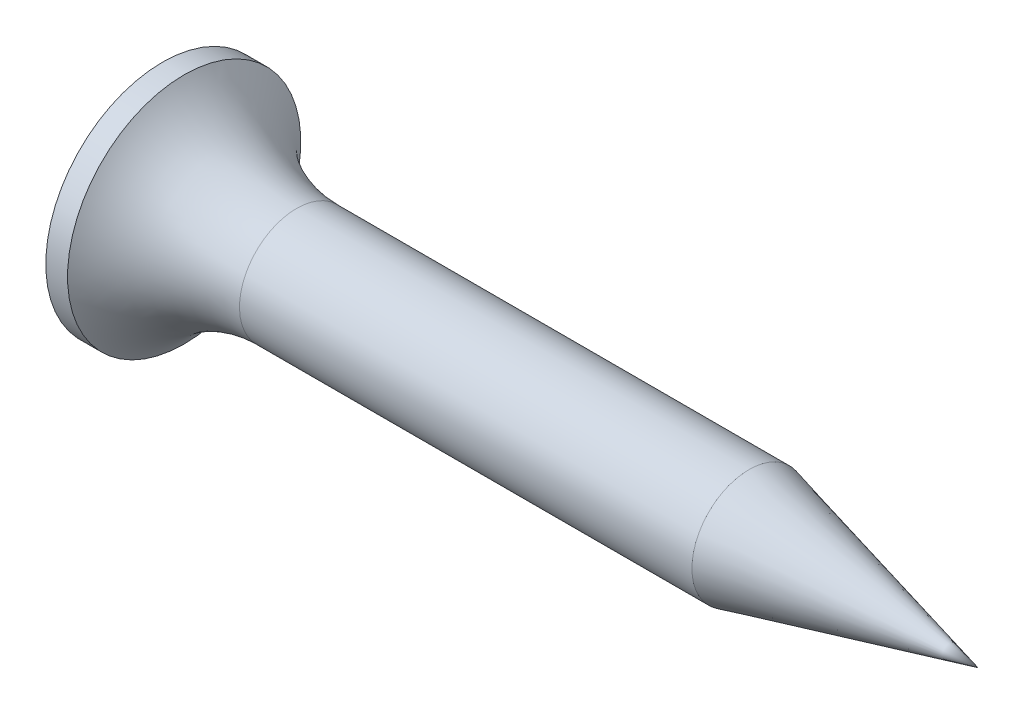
ISO-10303-21;
HEADER;
FILE_DESCRIPTION(('STEP AP214'),'2;1');
FILE_NAME('part.step','',(''),(''),'','','');
FILE_SCHEMA(('AUTOMOTIVE_DESIGN { 1 0 10303 214 1 1 1 1 }'));
ENDSEC;
DATA;
#1=APPLICATION_CONTEXT('core data for automotive mechanical design processes');
#2=APPLICATION_PROTOCOL_DEFINITION('international standard','automotive_design',2000,#1);
#3=PRODUCT_CONTEXT('',#1,'mechanical');
#4=PRODUCT('Part','Part','',(#3));
#5=PRODUCT_RELATED_PRODUCT_CATEGORY('part','',(#4));
#6=PRODUCT_DEFINITION_FORMATION('','',#4);
#7=PRODUCT_DEFINITION_CONTEXT('part definition',#1,'design');
#8=PRODUCT_DEFINITION('design','',#6,#7);
#9=PRODUCT_DEFINITION_SHAPE('','',#8);
#10=(LENGTH_UNIT() NAMED_UNIT(*) SI_UNIT(.MILLI.,.METRE.));
#11=(NAMED_UNIT(*) PLANE_ANGLE_UNIT() SI_UNIT($,.RADIAN.));
#12=(NAMED_UNIT(*) SI_UNIT($,.STERADIAN.) SOLID_ANGLE_UNIT());
#13=UNCERTAINTY_MEASURE_WITH_UNIT(LENGTH_MEASURE(1.E-05),#10,'distance_accuracy_value','');
#14=(GEOMETRIC_REPRESENTATION_CONTEXT(3) GLOBAL_UNCERTAINTY_ASSIGNED_CONTEXT((#13)) GLOBAL_UNIT_ASSIGNED_CONTEXT((#10,
#11,#12)) REPRESENTATION_CONTEXT('',''));
#15=CARTESIAN_POINT('',(0.,0.,0.));
#16=DIRECTION('',(0.,0.,1.));
#17=DIRECTION('',(1.,0.,0.));
#18=AXIS2_PLACEMENT_3D('',#15,#16,#17);
#19=CARTESIAN_POINT('',(0.,4.29,0.));
#20=DIRECTION('',(-1.,0.,0.));
#21=DIRECTION('',(0.,-1.,0.));
#22=AXIS2_PLACEMENT_3D('',#19,#20,#21);
#23=PLANE('',#22);
#24=CARTESIAN_POINT('',(0.,0.,0.));
#25=DIRECTION('',(1.,0.,0.));
#26=DIRECTION('',(0.,1.,0.));
#27=AXIS2_PLACEMENT_3D('',#24,#25,#26);
#28=CIRCLE('',#27,4.29);
#29=CARTESIAN_POINT('',(0.,4.29,0.));
#30=VERTEX_POINT('',#29);
#31=EDGE_CURVE('E11',#30,#30,#28,.T.);
#32=ORIENTED_EDGE('',*,*,#31,.F.);
#33=EDGE_LOOP('',(#32));
#34=FACE_BOUND('',#33,.T.);
#35=DIRECTION('',(0.,0.,1.));
#36=VECTOR('',#35,1.);
#37=CARTESIAN_POINT('',(0.,2.5,-0.500000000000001));
#38=LINE('',#37,#36);
#39=CARTESIAN_POINT('',(0.,2.5,-0.500000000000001));
#40=VERTEX_POINT('',#39);
#41=CARTESIAN_POINT('',(0.,2.5,0.500000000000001));
#42=VERTEX_POINT('',#41);
#43=EDGE_CURVE('E160',#40,#42,#38,.T.);
#44=ORIENTED_EDGE('',*,*,#43,.T.);
#45=DIRECTION('',(0.,-1.,0.));
#46=VECTOR('',#45,1.);
#47=CARTESIAN_POINT('',(0.,2.5,0.500000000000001));
#48=LINE('',#47,#46);
#49=CARTESIAN_POINT('',(0.,0.500000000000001,0.500000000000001));
#50=VERTEX_POINT('',#49);
#51=EDGE_CURVE('E56',#42,#50,#48,.T.);
#52=ORIENTED_EDGE('',*,*,#51,.T.);
#53=DIRECTION('',(0.,0.,1.));
#54=VECTOR('',#53,1.);
#55=CARTESIAN_POINT('',(0.,0.500000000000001,0.500000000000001));
#56=LINE('',#55,#54);
#57=CARTESIAN_POINT('',(0.,0.500000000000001,2.5));
#58=VERTEX_POINT('',#57);
#59=EDGE_CURVE('E164',#50,#58,#56,.T.);
#60=ORIENTED_EDGE('',*,*,#59,.T.);
#61=DIRECTION('',(0.,-1.,0.));
#62=VECTOR('',#61,1.);
#63=CARTESIAN_POINT('',(0.,0.500000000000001,2.5));
#64=LINE('',#63,#62);
#65=CARTESIAN_POINT('',(0.,-0.500000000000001,2.5));
#66=VERTEX_POINT('',#65);
#67=EDGE_CURVE('E209',#58,#66,#64,.T.);
#68=ORIENTED_EDGE('',*,*,#67,.T.);
#69=DIRECTION('',(0.,0.,-1.));
#70=VECTOR('',#69,1.);
#71=CARTESIAN_POINT('',(0.,-0.500000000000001,0.500000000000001));
#72=LINE('',#71,#70);
#73=CARTESIAN_POINT('',(0.,-0.500000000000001,0.500000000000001));
#74=VERTEX_POINT('',#73);
#75=EDGE_CURVE('E212',#66,#74,#72,.T.);
#76=ORIENTED_EDGE('',*,*,#75,.T.);
#77=DIRECTION('',(0.,-1.,0.));
#78=VECTOR('',#77,1.);
#79=CARTESIAN_POINT('',(0.,-2.5,0.500000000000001));
#80=LINE('',#79,#78);
#81=CARTESIAN_POINT('',(0.,-2.5,0.500000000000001));
#82=VERTEX_POINT('',#81);
#83=EDGE_CURVE('E215',#74,#82,#80,.T.);
#84=ORIENTED_EDGE('',*,*,#83,.T.);
#85=DIRECTION('',(0.,0.,-1.));
#86=VECTOR('',#85,1.);
#87=CARTESIAN_POINT('',(0.,-2.5,-0.500000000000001));
#88=LINE('',#87,#86);
#89=CARTESIAN_POINT('',(0.,-2.5,-0.500000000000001));
#90=VERTEX_POINT('',#89);
#91=EDGE_CURVE('E218',#82,#90,#88,.T.);
#92=ORIENTED_EDGE('',*,*,#91,.T.);
#93=DIRECTION('',(0.,1.,0.));
#94=VECTOR('',#93,1.);
#95=CARTESIAN_POINT('',(0.,-2.5,-0.500000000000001));
#96=LINE('',#95,#94);
#97=CARTESIAN_POINT('',(0.,-0.500000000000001,-0.500000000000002));
#98=VERTEX_POINT('',#97);
#99=EDGE_CURVE('E221',#90,#98,#96,.T.);
#100=ORIENTED_EDGE('',*,*,#99,.T.);
#101=DIRECTION('',(0.,0.,-1.));
#102=VECTOR('',#101,1.);
#103=CARTESIAN_POINT('',(0.,-0.500000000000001,-0.500000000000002));
#104=LINE('',#103,#102);
#105=CARTESIAN_POINT('',(0.,-0.500000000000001,-2.5));
#106=VERTEX_POINT('',#105);
#107=EDGE_CURVE('E224',#98,#106,#104,.T.);
#108=ORIENTED_EDGE('',*,*,#107,.T.);
#109=DIRECTION('',(0.,1.,0.));
#110=VECTOR('',#109,1.);
#111=CARTESIAN_POINT('',(0.,0.500000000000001,-2.5));
#112=LINE('',#111,#110);
#113=CARTESIAN_POINT('',(0.,0.500000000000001,-2.5));
#114=VERTEX_POINT('',#113);
#115=EDGE_CURVE('E227',#106,#114,#112,.T.);
#116=ORIENTED_EDGE('',*,*,#115,.T.);
#117=DIRECTION('',(0.,0.,1.));
#118=VECTOR('',#117,1.);
#119=CARTESIAN_POINT('',(0.,0.500000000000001,-0.500000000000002));
#120=LINE('',#119,#118);
#121=CARTESIAN_POINT('',(0.,0.500000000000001,-0.500000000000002));
#122=VERTEX_POINT('',#121);
#123=EDGE_CURVE('E230',#114,#122,#120,.T.);
#124=ORIENTED_EDGE('',*,*,#123,.T.);
#125=DIRECTION('',(0.,1.,0.));
#126=VECTOR('',#125,1.);
#127=CARTESIAN_POINT('',(0.,2.5,-0.500000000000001));
#128=LINE('',#127,#126);
#129=EDGE_CURVE('E233',#122,#40,#128,.T.);
#130=ORIENTED_EDGE('',*,*,#129,.T.);
#131=EDGE_LOOP('',(#44,#52,#60,#68,#76,#84,#92,#100,#108,#116,#124,#130));
#132=FACE_BOUND('',#131,.T.);
#133=ADVANCED_FACE('F37',(#34,#132),#23,.T.);
#134=CARTESIAN_POINT('',(30.,0.,0.));
#135=DIRECTION('',(1.,0.,0.));
#136=DIRECTION('',(0.,1.,0.));
#137=AXIS2_PLACEMENT_3D('',#134,#135,#136);
#138=CYLINDRICAL_SURFACE('',#137,4.29);
#139=ORIENTED_EDGE('',*,*,#31,.T.);
#140=EDGE_LOOP('',(#139));
#141=FACE_BOUND('',#140,.T.);
#142=CARTESIAN_POINT('',(0.799999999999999,0.,0.));
#143=DIRECTION('',(1.,0.,0.));
#144=DIRECTION('',(0.,1.,0.));
#145=AXIS2_PLACEMENT_3D('',#142,#143,#144);
#146=CIRCLE('',#145,4.29);
#147=CARTESIAN_POINT('',(0.799999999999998,4.29,0.));
#148=VERTEX_POINT('',#147);
#149=EDGE_CURVE('E47',#148,#148,#146,.T.);
#150=ORIENTED_EDGE('',*,*,#149,.F.);
#151=EDGE_LOOP('',(#150));
#152=FACE_BOUND('',#151,.T.);
#153=ADVANCED_FACE('F265',(#141,#152),#138,.T.);
#154=CARTESIAN_POINT('',(4.93568615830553,0.,0.));
#155=DIRECTION('',(1.,0.,0.));
#156=DIRECTION('',(0.,1.,0.));
#157=AXIS2_PLACEMENT_3D('',#154,#155,#156);
#158=TOROIDAL_SURFACE('',#157,7.1,5.);
#159=ORIENTED_EDGE('',*,*,#149,.T.);
#160=EDGE_LOOP('',(#159));
#161=FACE_BOUND('',#160,.T.);
#162=CARTESIAN_POINT('',(4.93568615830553,0.,0.));
#163=DIRECTION('',(1.,0.,0.));
#164=DIRECTION('',(0.,1.,0.));
#165=AXIS2_PLACEMENT_3D('',#162,#163,#164);
#166=CIRCLE('',#165,2.1);
#167=CARTESIAN_POINT('',(4.93568615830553,2.1,0.));
#168=VERTEX_POINT('',#167);
#169=EDGE_CURVE('E169',#168,#168,#166,.T.);
#170=ORIENTED_EDGE('',*,*,#169,.F.);
#171=EDGE_LOOP('',(#170));
#172=FACE_BOUND('',#171,.T.);
#173=ADVANCED_FACE('F271',(#161,#172),#158,.F.);
#174=CARTESIAN_POINT('',(30.,0.,0.));
#175=DIRECTION('',(1.,0.,0.));
#176=DIRECTION('',(0.,1.,0.));
#177=AXIS2_PLACEMENT_3D('',#174,#175,#176);
#178=CYLINDRICAL_SURFACE('',#177,2.1);
#179=ORIENTED_EDGE('',*,*,#169,.T.);
#180=EDGE_LOOP('',(#179));
#181=FACE_BOUND('',#180,.T.);
#182=CARTESIAN_POINT('',(21.5773600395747,0.,0.));
#183=DIRECTION('',(1.,0.,0.));
#184=DIRECTION('',(0.,1.,0.));
#185=AXIS2_PLACEMENT_3D('',#182,#183,#184);
#186=CIRCLE('',#185,2.1);
#187=CARTESIAN_POINT('',(21.5773600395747,2.1,0.));
#188=VERTEX_POINT('',#187);
#189=EDGE_CURVE('E165',#188,#188,#186,.T.);
#190=ORIENTED_EDGE('',*,*,#189,.F.);
#191=EDGE_LOOP('',(#190));
#192=FACE_BOUND('',#191,.T.);
#193=ADVANCED_FACE('F314',(#181,#192),#178,.T.);
#194=CARTESIAN_POINT('',(30.,0.,0.));
#195=DIRECTION('',(-1.,0.,0.));
#196=DIRECTION('',(0.,-1.,0.));
#197=AXIS2_PLACEMENT_3D('',#194,#195,#196);
#198=CONICAL_SURFACE('',#197,0.,0.244346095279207);
#199=ORIENTED_EDGE('',*,*,#189,.T.);
#200=EDGE_LOOP('',(#199));
#201=FACE_BOUND('',#200,.T.);
#202=CARTESIAN_POINT('',(30.,0.,0.));
#203=VERTEX_POINT('',#202);
#204=VERTEX_LOOP('',#203);
#205=FACE_BOUND('',#204,.T.);
#206=ADVANCED_FACE('F311',(#201,#205),#198,.T.);
#207=CARTESIAN_POINT('',(2.03142636,2.5,0.500000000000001));
#208=DIRECTION('',(0.,0.,-1.));
#209=DIRECTION('',(-1.,0.,0.));
#210=AXIS2_PLACEMENT_3D('',#207,#208,#209);
#211=PLANE('',#210);
#212=ORIENTED_EDGE('',*,*,#51,.F.);
#213=DIRECTION('',(-0.866025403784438,0.500000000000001,0.));
#214=VECTOR('',#213,1.);
#215=CARTESIAN_POINT('',(1.52356977,1.62036658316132,0.500000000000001));
#216=LINE('',#215,#214);
#217=CARTESIAN_POINT('',(2.03142636,1.3271554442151,0.500000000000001));
#218=VERTEX_POINT('',#217);
#219=EDGE_CURVE('E159',#218,#42,#216,.T.);
#220=ORIENTED_EDGE('',*,*,#219,.F.);
#221=DIRECTION('',(0.,-1.,0.));
#222=VECTOR('',#221,1.);
#223=CARTESIAN_POINT('',(2.03142636,2.5,0.500000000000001));
#224=LINE('',#223,#222);
#225=CARTESIAN_POINT('',(2.03142636,0.500000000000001,0.500000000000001));
#226=VERTEX_POINT('',#225);
#227=EDGE_CURVE('E150',#218,#226,#224,.T.);
#228=ORIENTED_EDGE('',*,*,#227,.T.);
#229=DIRECTION('',(-1.,0.,0.));
#230=VECTOR('',#229,1.);
#231=CARTESIAN_POINT('',(2.03142636,0.500000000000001,0.500000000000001));
#232=LINE('',#231,#230);
#233=EDGE_CURVE('E158',#226,#50,#232,.T.);
#234=ORIENTED_EDGE('',*,*,#233,.T.);
#235=EDGE_LOOP('',(#212,#220,#228,#234));
#236=FACE_BOUND('',#235,.T.);
#237=ADVANCED_FACE('F157',(#236),#211,.T.);
#238=CARTESIAN_POINT('',(2.03142636,0.500000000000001,0.500000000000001));
#239=DIRECTION('',(0.,-1.,0.));
#240=DIRECTION('',(0.,0.,-1.));
#241=AXIS2_PLACEMENT_3D('',#238,#239,#240);
#242=PLANE('',#241);
#243=ORIENTED_EDGE('',*,*,#59,.F.);
#244=ORIENTED_EDGE('',*,*,#233,.F.);
#245=DIRECTION('',(0.,0.,1.));
#246=VECTOR('',#245,1.);
#247=CARTESIAN_POINT('',(2.03142636,0.500000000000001,0.500000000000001));
#248=LINE('',#247,#246);
#249=CARTESIAN_POINT('',(2.03142636,0.500000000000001,1.3271554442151));
#250=VERTEX_POINT('',#249);
#251=EDGE_CURVE('E146',#226,#250,#248,.T.);
#252=ORIENTED_EDGE('',*,*,#251,.T.);
#253=DIRECTION('',(-0.866025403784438,0.,0.500000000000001));
#254=VECTOR('',#253,1.);
#255=CARTESIAN_POINT('',(0.,0.500000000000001,2.5));
#256=LINE('',#255,#254);
#257=EDGE_CURVE('E166',#250,#58,#256,.T.);
#258=ORIENTED_EDGE('',*,*,#257,.T.);
#259=EDGE_LOOP('',(#243,#244,#252,#258));
#260=FACE_BOUND('',#259,.T.);
#261=ADVANCED_FACE('F162',(#260),#242,.T.);
#262=CARTESIAN_POINT('',(0.,0.500000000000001,2.5));
#263=DIRECTION('',(-0.500000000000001,0.,-0.866025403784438));
#264=DIRECTION('',(-0.866025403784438,0.,0.500000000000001));
#265=AXIS2_PLACEMENT_3D('',#262,#263,#264);
#266=PLANE('',#265);
#267=ORIENTED_EDGE('',*,*,#67,.F.);
#268=ORIENTED_EDGE('',*,*,#257,.F.);
#269=DIRECTION('',(0.,-1.,0.));
#270=VECTOR('',#269,1.);
#271=CARTESIAN_POINT('',(2.03142636,-2.5,1.3271554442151));
#272=LINE('',#271,#270);
#273=CARTESIAN_POINT('',(2.03142636,-0.500000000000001,1.3271554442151));
#274=VERTEX_POINT('',#273);
#275=EDGE_CURVE('E152',#250,#274,#272,.T.);
#276=ORIENTED_EDGE('',*,*,#275,.T.);
#277=DIRECTION('',(-0.866025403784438,0.,0.500000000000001));
#278=VECTOR('',#277,1.);
#279=CARTESIAN_POINT('',(2.38959517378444,-0.500000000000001,1.12036658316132));
#280=LINE('',#279,#278);
#281=EDGE_CURVE('E171',#274,#66,#280,.T.);
#282=ORIENTED_EDGE('',*,*,#281,.T.);
#283=EDGE_LOOP('',(#267,#268,#276,#282));
#284=FACE_BOUND('',#283,.T.);
#285=ADVANCED_FACE('F277',(#284),#266,.T.);
#286=CARTESIAN_POINT('',(2.03142636,-0.500000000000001,0.500000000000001));
#287=DIRECTION('',(0.,1.,0.));
#288=DIRECTION('',(0.,0.,1.));
#289=AXIS2_PLACEMENT_3D('',#286,#287,#288);
#290=PLANE('',#289);
#291=ORIENTED_EDGE('',*,*,#75,.F.);
#292=ORIENTED_EDGE('',*,*,#281,.F.);
#293=DIRECTION('',(0.,0.,-1.));
#294=VECTOR('',#293,1.);
#295=CARTESIAN_POINT('',(2.03142636,-0.500000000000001,0.500000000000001));
#296=LINE('',#295,#294);
#297=CARTESIAN_POINT('',(2.03142636,-0.500000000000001,0.500000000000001));
#298=VERTEX_POINT('',#297);
#299=EDGE_CURVE('E183',#274,#298,#296,.T.);
#300=ORIENTED_EDGE('',*,*,#299,.T.);
#301=DIRECTION('',(-1.,0.,0.));
#302=VECTOR('',#301,1.);
#303=CARTESIAN_POINT('',(2.03142636,-0.500000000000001,0.500000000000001));
#304=LINE('',#303,#302);
#305=EDGE_CURVE('E174',#298,#74,#304,.T.);
#306=ORIENTED_EDGE('',*,*,#305,.T.);
#307=EDGE_LOOP('',(#291,#292,#300,#306));
#308=FACE_BOUND('',#307,.T.);
#309=ADVANCED_FACE('F280',(#308),#290,.T.);
#310=CARTESIAN_POINT('',(2.03142636,-2.5,0.500000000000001));
#311=DIRECTION('',(0.,0.,-1.));
#312=DIRECTION('',(-1.,0.,0.));
#313=AXIS2_PLACEMENT_3D('',#310,#311,#312);
#314=PLANE('',#313);
#315=ORIENTED_EDGE('',*,*,#83,.F.);
#316=ORIENTED_EDGE('',*,*,#305,.F.);
#317=DIRECTION('',(0.,-1.,0.));
#318=VECTOR('',#317,1.);
#319=CARTESIAN_POINT('',(2.03142636,-2.5,0.500000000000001));
#320=LINE('',#319,#318);
#321=CARTESIAN_POINT('',(2.03142636,-1.3271554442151,0.500000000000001));
#322=VERTEX_POINT('',#321);
#323=EDGE_CURVE('E197',#298,#322,#320,.T.);
#324=ORIENTED_EDGE('',*,*,#323,.T.);
#325=DIRECTION('',(-0.866025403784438,-0.500000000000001,0.));
#326=VECTOR('',#325,1.);
#327=CARTESIAN_POINT('',(0.,-2.5,0.500000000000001));
#328=LINE('',#327,#326);
#329=EDGE_CURVE('E193',#322,#82,#328,.T.);
#330=ORIENTED_EDGE('',*,*,#329,.T.);
#331=EDGE_LOOP('',(#315,#316,#324,#330));
#332=FACE_BOUND('',#331,.T.);
#333=ADVANCED_FACE('F285',(#332),#314,.T.);
#334=CARTESIAN_POINT('',(0.,-2.5,-0.500000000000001));
#335=DIRECTION('',(-0.500000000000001,0.866025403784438,0.));
#336=DIRECTION('',(-0.866025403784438,-0.500000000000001,0.));
#337=AXIS2_PLACEMENT_3D('',#334,#335,#336);
#338=PLANE('',#337);
#339=ORIENTED_EDGE('',*,*,#91,.F.);
#340=ORIENTED_EDGE('',*,*,#329,.F.);
#341=DIRECTION('',(0.,0.,-1.));
#342=VECTOR('',#341,1.);
#343=CARTESIAN_POINT('',(2.03142636,-1.3271554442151,0.500000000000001));
#344=LINE('',#343,#342);
#345=CARTESIAN_POINT('',(2.03142636,-1.3271554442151,-0.500000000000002));
#346=VERTEX_POINT('',#345);
#347=EDGE_CURVE('E195',#322,#346,#344,.T.);
#348=ORIENTED_EDGE('',*,*,#347,.T.);
#349=DIRECTION('',(-0.866025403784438,-0.500000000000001,0.));
#350=VECTOR('',#349,1.);
#351=CARTESIAN_POINT('',(1.52356977,-1.62036658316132,-0.500000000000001));
#352=LINE('',#351,#350);
#353=EDGE_CURVE('E191',#346,#90,#352,.T.);
#354=ORIENTED_EDGE('',*,*,#353,.T.);
#355=EDGE_LOOP('',(#339,#340,#348,#354));
#356=FACE_BOUND('',#355,.T.);
#357=ADVANCED_FACE('F283',(#356),#338,.T.);
#358=CARTESIAN_POINT('',(2.03142636,-2.5,-0.500000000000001));
#359=DIRECTION('',(0.,0.,1.));
#360=DIRECTION('',(0.,-1.,0.));
#361=AXIS2_PLACEMENT_3D('',#358,#359,#360);
#362=PLANE('',#361);
#363=ORIENTED_EDGE('',*,*,#99,.F.);
#364=ORIENTED_EDGE('',*,*,#353,.F.);
#365=DIRECTION('',(0.,1.,0.));
#366=VECTOR('',#365,1.);
#367=CARTESIAN_POINT('',(2.03142636,-2.5,-0.500000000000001));
#368=LINE('',#367,#366);
#369=CARTESIAN_POINT('',(2.03142636,-0.500000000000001,-0.500000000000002));
#370=VERTEX_POINT('',#369);
#371=EDGE_CURVE('E105',#346,#370,#368,.T.);
#372=ORIENTED_EDGE('',*,*,#371,.T.);
#373=DIRECTION('',(-1.,0.,0.));
#374=VECTOR('',#373,1.);
#375=CARTESIAN_POINT('',(2.03142636,-0.500000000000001,-0.500000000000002));
#376=LINE('',#375,#374);
#377=EDGE_CURVE('E194',#370,#98,#376,.T.);
#378=ORIENTED_EDGE('',*,*,#377,.T.);
#379=EDGE_LOOP('',(#363,#364,#372,#378));
#380=FACE_BOUND('',#379,.T.);
#381=ADVANCED_FACE('F246',(#380),#362,.T.);
#382=CARTESIAN_POINT('',(2.03142636,-0.500000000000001,-0.500000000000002));
#383=DIRECTION('',(0.,1.,0.));
#384=DIRECTION('',(0.,0.,1.));
#385=AXIS2_PLACEMENT_3D('',#382,#383,#384);
#386=PLANE('',#385);
#387=ORIENTED_EDGE('',*,*,#107,.F.);
#388=ORIENTED_EDGE('',*,*,#377,.F.);
#389=DIRECTION('',(0.,0.,-1.));
#390=VECTOR('',#389,1.);
#391=CARTESIAN_POINT('',(2.03142636,-0.500000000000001,-0.500000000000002));
#392=LINE('',#391,#390);
#393=CARTESIAN_POINT('',(2.03142636,-0.500000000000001,-1.3271554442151));
#394=VERTEX_POINT('',#393);
#395=EDGE_CURVE('E98',#370,#394,#392,.T.);
#396=ORIENTED_EDGE('',*,*,#395,.T.);
#397=DIRECTION('',(-0.866025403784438,0.,-0.500000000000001));
#398=VECTOR('',#397,1.);
#399=CARTESIAN_POINT('',(0.,-0.500000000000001,-2.5));
#400=LINE('',#399,#398);
#401=EDGE_CURVE('E41',#394,#106,#400,.T.);
#402=ORIENTED_EDGE('',*,*,#401,.T.);
#403=EDGE_LOOP('',(#387,#388,#396,#402));
#404=FACE_BOUND('',#403,.T.);
#405=ADVANCED_FACE('F241',(#404),#386,.T.);
#406=CARTESIAN_POINT('',(0.,0.500000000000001,-2.5));
#407=DIRECTION('',(-0.500000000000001,0.,0.866025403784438));
#408=DIRECTION('',(0.866025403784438,0.,0.500000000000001));
#409=AXIS2_PLACEMENT_3D('',#406,#407,#408);
#410=PLANE('',#409);
#411=ORIENTED_EDGE('',*,*,#115,.F.);
#412=ORIENTED_EDGE('',*,*,#401,.F.);
#413=DIRECTION('',(0.,1.,0.));
#414=VECTOR('',#413,1.);
#415=CARTESIAN_POINT('',(2.03142636,-2.5,-1.3271554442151));
#416=LINE('',#415,#414);
#417=CARTESIAN_POINT('',(2.03142636,0.500000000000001,-1.3271554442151));
#418=VERTEX_POINT('',#417);
#419=EDGE_CURVE('E89',#394,#418,#416,.T.);
#420=ORIENTED_EDGE('',*,*,#419,.T.);
#421=DIRECTION('',(-0.866025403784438,0.,-0.500000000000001));
#422=VECTOR('',#421,1.);
#423=CARTESIAN_POINT('',(2.38959517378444,0.500000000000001,-1.12036658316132));
#424=LINE('',#423,#422);
#425=EDGE_CURVE('E199',#418,#114,#424,.T.);
#426=ORIENTED_EDGE('',*,*,#425,.T.);
#427=EDGE_LOOP('',(#411,#412,#420,#426));
#428=FACE_BOUND('',#427,.T.);
#429=ADVANCED_FACE('F242',(#428),#410,.T.);
#430=CARTESIAN_POINT('',(2.03142636,0.500000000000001,-0.500000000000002));
#431=DIRECTION('',(0.,-1.,0.));
#432=DIRECTION('',(0.,0.,-1.));
#433=AXIS2_PLACEMENT_3D('',#430,#431,#432);
#434=PLANE('',#433);
#435=ORIENTED_EDGE('',*,*,#123,.F.);
#436=ORIENTED_EDGE('',*,*,#425,.F.);
#437=DIRECTION('',(0.,0.,1.));
#438=VECTOR('',#437,1.);
#439=CARTESIAN_POINT('',(2.03142636,0.500000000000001,-0.500000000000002));
#440=LINE('',#439,#438);
#441=CARTESIAN_POINT('',(2.03142636,0.500000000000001,-0.500000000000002));
#442=VERTEX_POINT('',#441);
#443=EDGE_CURVE('E200',#418,#442,#440,.T.);
#444=ORIENTED_EDGE('',*,*,#443,.T.);
#445=DIRECTION('',(-1.,0.,0.));
#446=VECTOR('',#445,1.);
#447=CARTESIAN_POINT('',(2.03142636,0.500000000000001,-0.500000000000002));
#448=LINE('',#447,#446);
#449=EDGE_CURVE('E190',#442,#122,#448,.T.);
#450=ORIENTED_EDGE('',*,*,#449,.T.);
#451=EDGE_LOOP('',(#435,#436,#444,#450));
#452=FACE_BOUND('',#451,.T.);
#453=ADVANCED_FACE('F254',(#452),#434,.T.);
#454=CARTESIAN_POINT('',(2.03142636,2.5,-0.500000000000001));
#455=DIRECTION('',(0.,0.,1.));
#456=DIRECTION('',(0.,-1.,0.));
#457=AXIS2_PLACEMENT_3D('',#454,#455,#456);
#458=PLANE('',#457);
#459=ORIENTED_EDGE('',*,*,#129,.F.);
#460=ORIENTED_EDGE('',*,*,#449,.F.);
#461=DIRECTION('',(0.,1.,0.));
#462=VECTOR('',#461,1.);
#463=CARTESIAN_POINT('',(2.03142636,2.5,-0.500000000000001));
#464=LINE('',#463,#462);
#465=CARTESIAN_POINT('',(2.03142636,1.3271554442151,-0.500000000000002));
#466=VERTEX_POINT('',#465);
#467=EDGE_CURVE('E188',#442,#466,#464,.T.);
#468=ORIENTED_EDGE('',*,*,#467,.T.);
#469=DIRECTION('',(-0.866025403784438,0.500000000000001,0.));
#470=VECTOR('',#469,1.);
#471=CARTESIAN_POINT('',(0.,2.5,-0.500000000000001));
#472=LINE('',#471,#470);
#473=EDGE_CURVE('E140',#466,#40,#472,.T.);
#474=ORIENTED_EDGE('',*,*,#473,.T.);
#475=EDGE_LOOP('',(#459,#460,#468,#474));
#476=FACE_BOUND('',#475,.T.);
#477=ADVANCED_FACE('F255',(#476),#458,.T.);
#478=CARTESIAN_POINT('',(0.,2.5,-0.500000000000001));
#479=DIRECTION('',(-0.500000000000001,-0.866025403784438,0.));
#480=DIRECTION('',(0.866025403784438,-0.500000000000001,0.));
#481=AXIS2_PLACEMENT_3D('',#478,#479,#480);
#482=PLANE('',#481);
#483=ORIENTED_EDGE('',*,*,#43,.F.);
#484=ORIENTED_EDGE('',*,*,#473,.F.);
#485=DIRECTION('',(0.,0.,1.));
#486=VECTOR('',#485,1.);
#487=CARTESIAN_POINT('',(2.03142636,1.3271554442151,0.500000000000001));
#488=LINE('',#487,#486);
#489=EDGE_CURVE('E186',#466,#218,#488,.T.);
#490=ORIENTED_EDGE('',*,*,#489,.T.);
#491=ORIENTED_EDGE('',*,*,#219,.T.);
#492=EDGE_LOOP('',(#483,#484,#490,#491));
#493=FACE_BOUND('',#492,.T.);
#494=ADVANCED_FACE('F39',(#493),#482,.T.);
#495=CARTESIAN_POINT('',(2.03142636,-2.5,0.500000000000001));
#496=DIRECTION('',(-1.,0.,0.));
#497=DIRECTION('',(0.,0.,1.));
#498=AXIS2_PLACEMENT_3D('',#495,#496,#497);
#499=PLANE('',#498);
#500=ORIENTED_EDGE('',*,*,#227,.F.);
#501=ORIENTED_EDGE('',*,*,#489,.F.);
#502=ORIENTED_EDGE('',*,*,#467,.F.);
#503=ORIENTED_EDGE('',*,*,#443,.F.);
#504=ORIENTED_EDGE('',*,*,#419,.F.);
#505=ORIENTED_EDGE('',*,*,#395,.F.);
#506=ORIENTED_EDGE('',*,*,#371,.F.);
#507=ORIENTED_EDGE('',*,*,#347,.F.);
#508=ORIENTED_EDGE('',*,*,#323,.F.);
#509=ORIENTED_EDGE('',*,*,#299,.F.);
#510=ORIENTED_EDGE('',*,*,#275,.F.);
#511=ORIENTED_EDGE('',*,*,#251,.F.);
#512=EDGE_LOOP('',(#500,#501,#502,#503,#504,#505,#506,#507,#508,#509,#510,#511));
#513=FACE_BOUND('',#512,.T.);
#514=ADVANCED_FACE('F148',(#513),#499,.T.);
#515=CLOSED_SHELL('',(#133,#153,#173,#193,#206,#237,#261,#285,#309,#333,#357,#381,#405,#429,
#453,#477,#494,#514));
#516=MANIFOLD_SOLID_BREP('B2',#515);
#517=ADVANCED_BREP_SHAPE_REPRESENTATION('',(#18,#516),#14);
#518=SHAPE_DEFINITION_REPRESENTATION(#9,#517);
ENDSEC;
END-ISO-10303-21;
